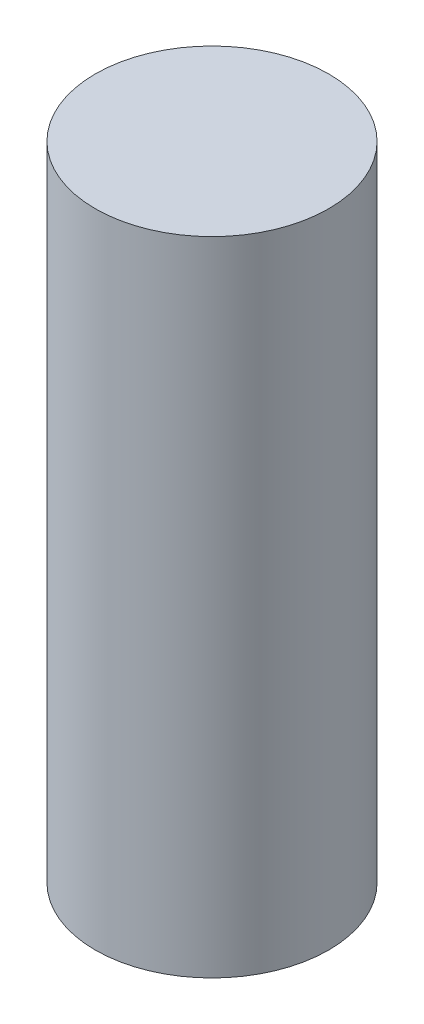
from build123d import *

# Parameters (mm, degrees)
ESQUISSE1_W = 1
ESQUISSE1_H = 5.5


with BuildPart() as part:
    # Esquisse1 → R_volution1 (revolve)
    with BuildSketch(Plane.XY, mode=Mode.PRIVATE) as r_volution1_sk:
        with Locations((0.5, 7.25)):
            Rectangle(ESQUISSE1_W, ESQUISSE1_H)
    revolve(r_volution1_sk.sketch.rotate(Axis((0, 10, 0), (0, -1, 0)), 270), axis=Axis((0, 10, 0), (0, -1, 0)))


solid = part.part
